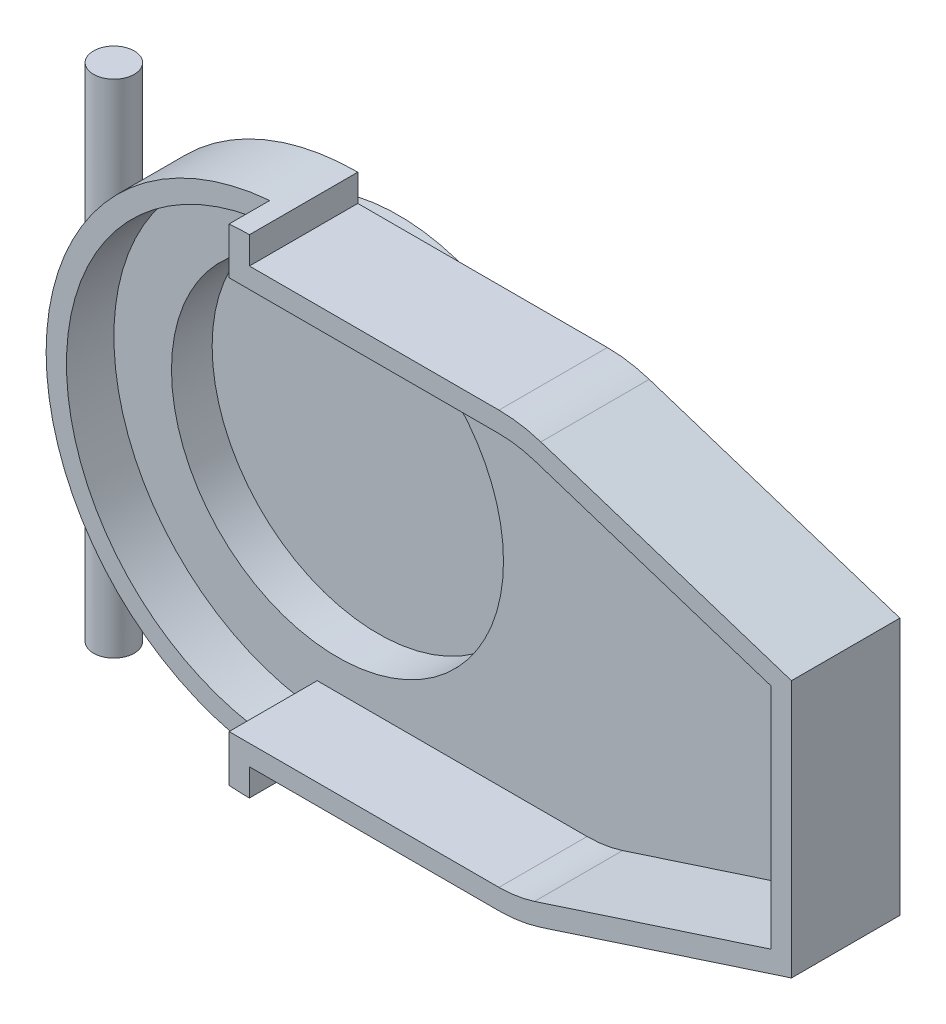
from build123d import *

# Parameters (mm, degrees)
ESQUISSE1_R                  = 13.75
EXTRUSION1_DEPTH             = 3
EXTRUSION2_DEPTH             = 8
COQUE1_T                     = -1.5
ENL_V_MAT_EXTRU_1_DEPTH      = 46.221676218
ENL_V_MAT_EXTRU_1_DEPTH_BACK = 46.221676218
ESQUISSE4_W                  = 22.445950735
ESQUISSE4_H                  = 7.950203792
EXTRUSION3_REACH             = 57.256
EXTRUSION3_END_RADIUS        = 18
ESQUISSE5_R                  = 1.5


with BuildPart() as part:
    # Esquisse1 → Extrusion1 (new body)
    with BuildSketch(Plane.XY):
        Circle(ESQUISSE1_R)
    extrude(amount=EXTRUSION1_DEPTH)

    # Esquisse3 → Extrusion2 (add)
    with BuildSketch(Plane(origin=(137.692448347, 0, 3), x_dir=(1, 0, 0), z_dir=(0, 0, 1))):
        with BuildLine():
            Line((-137.692448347, -16), (-119.276665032, -16))
            ThreePointArc((-119.276665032, -16), (-117.711961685, -15.876826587), (-116.185804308, -15.510340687))
            Line((-116.185804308, -15.510340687), (-97.692448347, -9.5))
            Line((-97.692448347, -9.5), (-97.692448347, 9.5))
            Line((-97.692448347, 9.5), (-116.185804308, 15.510340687))
            ThreePointArc((-116.185804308, 15.510340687), (-117.711961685, 15.876826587), (-119.276665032, 16))
            Line((-119.276665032, 16), (-137.692448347, 16))
            Line((-137.692448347, 16), (-137.692448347, 18))
            ThreePointArc((-137.692448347, 18), (-155.692448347, 0), (-137.692448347, -18))
            Line((-137.692448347, -18), (-137.692448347, -16))
        make_face()
    extrude(amount=EXTRUSION2_DEPTH)

    # Coque1
    coque1_openings = [part.faces().sort_by_distance(p)[0] for p in [
        (10.474281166, 0, 11),
    ]]
    offset(amount=COQUE1_T, openings=coque1_openings, kind=Kind.INTERSECTION)

    # Esquisse4 → Enl_v. mat.-Extru.1 (cut, two sides: drawn at the far end of the back side and taken through both)
    with BuildSketch(Plane(origin=(0, 0, 0), x_dir=(1, 0, 0), z_dir=(0, 1, 0)).offset(-ENL_V_MAT_EXTRU_1_DEPTH_BACK)):
        with Locations((-12.722975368, -11.975101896)):
            Rectangle(ESQUISSE4_W, ESQUISSE4_H)
    extrude(amount=ENL_V_MAT_EXTRU_1_DEPTH + ENL_V_MAT_EXTRU_1_DEPTH_BACK, mode=Mode.SUBTRACT)

    # Extrusion3: up to this cylinder (the profile starts outside it)
    extrusion3_end = Plane(origin=(0, 0, 5.5), z_dir=(0, 0, -1)) * Cylinder(EXTRUSION3_END_RADIUS, 151.512, mode=Mode.PRIVATE)
    # Esquisse5 → Extrusion3 (add, up to the surface)
    with BuildSketch(Plane(origin=(0, 18.5, 0), x_dir=(-1, 0, 0), z_dir=(0, 1, 0)), mode=Mode.PRIVATE) as extrusion3_sk1:
        with Locations(Location((15.5, 5.5, 0), (0, 0, 90))):
            Circle(ESQUISSE5_R)
    extrusion3_tool1 = extrude(extrusion3_sk1.sketch, amount=-EXTRUSION3_REACH, mode=Mode.PRIVATE) - extrusion3_end
    extrusion3 = extrusion3_tool1.solids().sort_by_distance((-15.5, 18.5, 5.5))[0]
    add(extrusion3)

    # Sym_trie1: Extrusion3 across plane
    add(extrusion3.mirror(Plane.ZX))


solid = part.part
